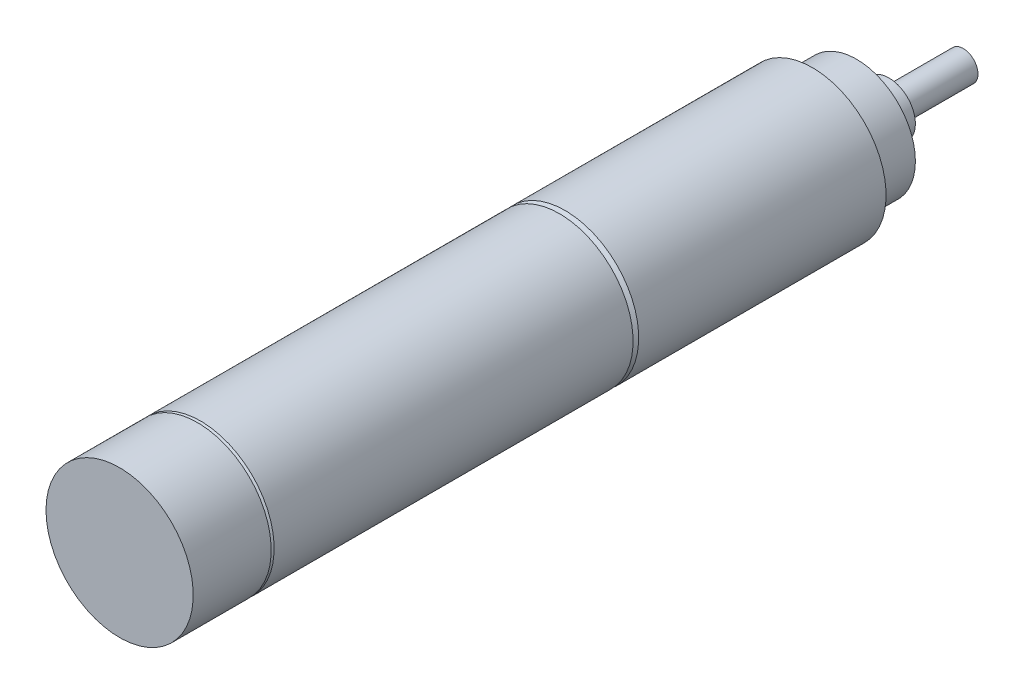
ISO-10303-21;
HEADER;
FILE_DESCRIPTION(('STEP AP214'),'2;1');
FILE_NAME('part.step','',(''),(''),'','','');
FILE_SCHEMA(('AUTOMOTIVE_DESIGN { 1 0 10303 214 1 1 1 1 }'));
ENDSEC;
DATA;
#1=APPLICATION_CONTEXT('core data for automotive mechanical design processes');
#2=APPLICATION_PROTOCOL_DEFINITION('international standard','automotive_design',2000,#1);
#3=PRODUCT_CONTEXT('',#1,'mechanical');
#4=PRODUCT('Part','Part','',(#3));
#5=PRODUCT_RELATED_PRODUCT_CATEGORY('part','',(#4));
#6=PRODUCT_DEFINITION_FORMATION('','',#4);
#7=PRODUCT_DEFINITION_CONTEXT('part definition',#1,'design');
#8=PRODUCT_DEFINITION('design','',#6,#7);
#9=PRODUCT_DEFINITION_SHAPE('','',#8);
#10=(LENGTH_UNIT() NAMED_UNIT(*) SI_UNIT(.MILLI.,.METRE.));
#11=(NAMED_UNIT(*) PLANE_ANGLE_UNIT() SI_UNIT($,.RADIAN.));
#12=(NAMED_UNIT(*) SI_UNIT($,.STERADIAN.) SOLID_ANGLE_UNIT());
#13=UNCERTAINTY_MEASURE_WITH_UNIT(LENGTH_MEASURE(1.E-05),#10,'distance_accuracy_value','');
#14=(GEOMETRIC_REPRESENTATION_CONTEXT(3) GLOBAL_UNCERTAINTY_ASSIGNED_CONTEXT((#13)) GLOBAL_UNIT_ASSIGNED_CONTEXT((#10,
#11,#12)) REPRESENTATION_CONTEXT('',''));
#15=CARTESIAN_POINT('',(0.,0.,0.));
#16=DIRECTION('',(0.,0.,1.));
#17=DIRECTION('',(1.,0.,0.));
#18=AXIS2_PLACEMENT_3D('',#15,#16,#17);
#19=CARTESIAN_POINT('',(0.,0.,-3.99719999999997));
#20=DIRECTION('',(0.,0.,-0.999999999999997));
#21=DIRECTION('',(-1.,0.,0.));
#22=AXIS2_PLACEMENT_3D('',#19,#20,#21);
#23=PLANE('',#22);
#24=CARTESIAN_POINT('',(0.,0.,-3.99719999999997));
#25=DIRECTION('',(0.,0.,-0.999999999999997));
#26=DIRECTION('',(-1.,0.,0.));
#27=AXIS2_PLACEMENT_3D('',#24,#25,#26);
#28=CIRCLE('',#27,2.5);
#29=CARTESIAN_POINT('',(2.50000000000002,0.,-3.99719999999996));
#30=VERTEX_POINT('',#29);
#31=EDGE_CURVE('E90',#30,#30,#28,.T.);
#32=ORIENTED_EDGE('',*,*,#31,.T.);
#33=EDGE_LOOP('',(#32));
#34=FACE_BOUND('',#33,.T.);
#35=CARTESIAN_POINT('',(0.,0.,-3.99719999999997));
#36=DIRECTION('',(0.,0.,-0.999999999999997));
#37=DIRECTION('',(-1.,0.,0.));
#38=AXIS2_PLACEMENT_3D('',#35,#36,#37);
#39=CIRCLE('',#38,1.8);
#40=CARTESIAN_POINT('',(1.80000000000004,0.,-3.99719999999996));
#41=VERTEX_POINT('',#40);
#42=EDGE_CURVE('E102',#41,#41,#39,.T.);
#43=ORIENTED_EDGE('',*,*,#42,.F.);
#44=EDGE_LOOP('',(#43));
#45=FACE_BOUND('',#44,.T.);
#46=ADVANCED_FACE('F39',(#34,#45),#23,.T.);
#47=CARTESIAN_POINT('',(0.,0.,-2.99719999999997));
#48=DIRECTION('',(0.,0.,-0.999999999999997));
#49=DIRECTION('',(-1.,0.,0.));
#50=AXIS2_PLACEMENT_3D('',#47,#48,#49);
#51=PLANE('',#50);
#52=CARTESIAN_POINT('',(0.,0.,-2.99719999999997));
#53=DIRECTION('',(0.,0.,-0.999999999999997));
#54=DIRECTION('',(-1.,0.,0.));
#55=AXIS2_PLACEMENT_3D('',#52,#53,#54);
#56=CIRCLE('',#55,4.0005);
#57=CARTESIAN_POINT('',(4.00050000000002,0.,-2.99719999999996));
#58=VERTEX_POINT('',#57);
#59=EDGE_CURVE('E75',#58,#58,#56,.T.);
#60=ORIENTED_EDGE('',*,*,#59,.T.);
#61=EDGE_LOOP('',(#60));
#62=FACE_BOUND('',#61,.T.);
#63=CARTESIAN_POINT('',(0.,0.,-2.99719999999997));
#64=DIRECTION('',(0.,0.,-0.999999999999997));
#65=DIRECTION('',(-1.,0.,0.));
#66=AXIS2_PLACEMENT_3D('',#63,#64,#65);
#67=CIRCLE('',#66,2.5);
#68=CARTESIAN_POINT('',(2.50000000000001,0.,-2.99719999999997));
#69=VERTEX_POINT('',#68);
#70=EDGE_CURVE('E94',#69,#69,#67,.T.);
#71=ORIENTED_EDGE('',*,*,#70,.F.);
#72=EDGE_LOOP('',(#71));
#73=FACE_BOUND('',#72,.T.);
#74=ADVANCED_FACE('F110',(#62,#73),#51,.T.);
#75=CARTESIAN_POINT('',(0.,0.,0.));
#76=DIRECTION('',(0.,0.,0.999999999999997));
#77=DIRECTION('',(1.,0.,0.));
#78=AXIS2_PLACEMENT_3D('',#75,#76,#77);
#79=PLANE('',#78);
#80=CARTESIAN_POINT('',(0.,0.,0.));
#81=DIRECTION('',(0.,0.,0.999999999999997));
#82=DIRECTION('',(1.,0.,0.));
#83=AXIS2_PLACEMENT_3D('',#80,#81,#82);
#84=CIRCLE('',#83,5.0038);
#85=CARTESIAN_POINT('',(-5.00379999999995,0.,0.));
#86=VERTEX_POINT('',#85);
#87=EDGE_CURVE('E68',#86,#86,#84,.T.);
#88=ORIENTED_EDGE('',*,*,#87,.F.);
#89=EDGE_LOOP('',(#88));
#90=FACE_BOUND('',#89,.T.);
#91=CARTESIAN_POINT('',(0.,0.,0.));
#92=DIRECTION('',(0.,0.,0.999999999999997));
#93=DIRECTION('',(1.,0.,0.));
#94=AXIS2_PLACEMENT_3D('',#91,#92,#93);
#95=CIRCLE('',#94,4.0005);
#96=CARTESIAN_POINT('',(4.00050000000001,0.,0.));
#97=VERTEX_POINT('',#96);
#98=EDGE_CURVE('E54',#97,#97,#95,.F.);
#99=ORIENTED_EDGE('',*,*,#98,.F.);
#100=EDGE_LOOP('',(#99));
#101=FACE_BOUND('',#100,.T.);
#102=ADVANCED_FACE('F116',(#90,#101),#79,.F.);
#103=CARTESIAN_POINT('',(0.,0.,17.1957999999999));
#104=DIRECTION('',(0.,0.,-0.999999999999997));
#105=DIRECTION('',(-1.,0.,0.));
#106=AXIS2_PLACEMENT_3D('',#103,#104,#105);
#107=CYLINDRICAL_SURFACE('',#106,5.0038);
#108=CARTESIAN_POINT('',(0.,0.,16.8147999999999));
#109=DIRECTION('',(0.,0.,0.999999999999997));
#110=DIRECTION('',(1.,0.,0.));
#111=AXIS2_PLACEMENT_3D('',#108,#109,#110);
#112=CIRCLE('',#111,5.0038);
#113=CARTESIAN_POINT('',(-5.00379999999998,0.,16.8147999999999));
#114=VERTEX_POINT('',#113);
#115=EDGE_CURVE('E60',#114,#114,#112,.F.);
#116=CARTESIAN_POINT('',(-5.00379999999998,0.,16.8147999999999));
#117=CARTESIAN_POINT('',(-5.00379999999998,0.,16.6396458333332));
#118=CARTESIAN_POINT('',(-5.00379999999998,0.,16.4644916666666));
#119=CARTESIAN_POINT('',(-5.00379999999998,0.,16.1141833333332));
#120=CARTESIAN_POINT('',(-5.00379999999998,0.,15.9390291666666));
#121=CARTESIAN_POINT('',(-5.00379999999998,0.,15.5887208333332));
#122=CARTESIAN_POINT('',(-5.00379999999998,0.,15.4135666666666));
#123=CARTESIAN_POINT('',(-5.00379999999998,0.,15.0632583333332));
#124=CARTESIAN_POINT('',(-5.00379999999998,0.,14.8881041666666));
#125=CARTESIAN_POINT('',(-5.00379999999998,0.,14.5377958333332));
#126=CARTESIAN_POINT('',(-5.00379999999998,0.,14.3626416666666));
#127=CARTESIAN_POINT('',(-5.00379999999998,0.,14.0123333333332));
#128=CARTESIAN_POINT('',(-5.00379999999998,0.,13.8371791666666));
#129=CARTESIAN_POINT('',(-5.00379999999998,0.,13.4868708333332));
#130=CARTESIAN_POINT('',(-5.00379999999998,0.,13.3117166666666));
#131=CARTESIAN_POINT('',(-5.00379999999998,0.,12.9614083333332));
#132=CARTESIAN_POINT('',(-5.00379999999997,0.,12.7862541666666));
#133=CARTESIAN_POINT('',(-5.00379999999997,0.,12.4359458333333));
#134=CARTESIAN_POINT('',(-5.00379999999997,0.,12.2607916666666));
#135=CARTESIAN_POINT('',(-5.00379999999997,0.,11.9104833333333));
#136=CARTESIAN_POINT('',(-5.00379999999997,0.,11.7353291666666));
#137=CARTESIAN_POINT('',(-5.00379999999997,0.,11.3850208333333));
#138=CARTESIAN_POINT('',(-5.00379999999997,0.,11.2098666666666));
#139=CARTESIAN_POINT('',(-5.00379999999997,0.,10.8595583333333));
#140=CARTESIAN_POINT('',(-5.00379999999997,0.,10.6844041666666));
#141=CARTESIAN_POINT('',(-5.00379999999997,0.,10.3340958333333));
#142=CARTESIAN_POINT('',(-5.00379999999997,0.,10.1589416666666));
#143=CARTESIAN_POINT('',(-5.00379999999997,0.,9.80863333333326));
#144=CARTESIAN_POINT('',(-5.00379999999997,0.,9.6334791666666));
#145=CARTESIAN_POINT('',(-5.00379999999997,0.,9.28317083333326));
#146=CARTESIAN_POINT('',(-5.00379999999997,0.,9.1080166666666));
#147=CARTESIAN_POINT('',(-5.00379999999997,0.,8.75770833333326));
#148=CARTESIAN_POINT('',(-5.00379999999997,0.,8.5825541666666));
#149=CARTESIAN_POINT('',(-5.00379999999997,0.,8.23224583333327));
#150=CARTESIAN_POINT('',(-5.00379999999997,0.,8.0570916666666));
#151=CARTESIAN_POINT('',(-5.00379999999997,0.,7.70678333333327));
#152=CARTESIAN_POINT('',(-5.00379999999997,0.,7.5316291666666));
#153=CARTESIAN_POINT('',(-5.00379999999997,0.,7.18132083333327));
#154=CARTESIAN_POINT('',(-5.00379999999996,0.,7.0061666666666));
#155=CARTESIAN_POINT('',(-5.00379999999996,0.,6.65585833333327));
#156=CARTESIAN_POINT('',(-5.00379999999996,0.,6.48070416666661));
#157=CARTESIAN_POINT('',(-5.00379999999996,0.,6.13039583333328));
#158=CARTESIAN_POINT('',(-5.00379999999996,0.,5.95524166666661));
#159=CARTESIAN_POINT('',(-5.00379999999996,0.,5.60493333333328));
#160=CARTESIAN_POINT('',(-5.00379999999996,0.,5.42977916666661));
#161=CARTESIAN_POINT('',(-5.00379999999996,0.,5.07947083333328));
#162=CARTESIAN_POINT('',(-5.00379999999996,0.,4.90431666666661));
#163=CARTESIAN_POINT('',(-5.00379999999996,0.,4.55400833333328));
#164=CARTESIAN_POINT('',(-5.00379999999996,0.,4.37885416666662));
#165=CARTESIAN_POINT('',(-5.00379999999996,0.,4.02854583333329));
#166=CARTESIAN_POINT('',(-5.00379999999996,0.,3.85339166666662));
#167=CARTESIAN_POINT('',(-5.00379999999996,0.,3.50308333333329));
#168=CARTESIAN_POINT('',(-5.00379999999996,0.,3.32792916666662));
#169=CARTESIAN_POINT('',(-5.00379999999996,0.,2.97762083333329));
#170=CARTESIAN_POINT('',(-5.00379999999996,0.,2.80246666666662));
#171=CARTESIAN_POINT('',(-5.00379999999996,0.,2.45215833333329));
#172=CARTESIAN_POINT('',(-5.00379999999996,0.,2.27700416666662));
#173=CARTESIAN_POINT('',(-5.00379999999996,0.,1.92669583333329));
#174=CARTESIAN_POINT('',(-5.00379999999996,0.,1.75154166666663));
#175=CARTESIAN_POINT('',(-5.00379999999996,0.,1.4012333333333));
#176=CARTESIAN_POINT('',(-5.00379999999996,0.,1.22607916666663));
#177=CARTESIAN_POINT('',(-5.00379999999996,0.,0.875770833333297));
#178=CARTESIAN_POINT('',(-5.00379999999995,0.,0.700616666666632));
#179=CARTESIAN_POINT('',(-5.00379999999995,0.,0.3503083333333));
#180=CARTESIAN_POINT('',(-5.00379999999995,0.,0.175154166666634));
#181=CARTESIAN_POINT('',(-5.00379999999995,0.,0.));
#182=B_SPLINE_CURVE_WITH_KNOTS('',3,(#116,#117,#118,#119,#120,#121,#122,#123,#124,#125,#126,
#127,#128,#129,#130,#131,#132,#133,#134,#135,#136,#137,#138,#139,#140,#141,#142,#143,#144,#145,
#146,#147,#148,#149,#150,#151,#152,#153,#154,#155,#156,#157,#158,#159,#160,#161,#162,#163,#164,
#165,#166,#167,#168,#169,#170,#171,#172,#173,#174,#175,#176,#177,#178,#179,#180,#181),
.UNSPECIFIED.,.F.,.F.,(4,2,2,2,2,2,2,2,2,2,2,2,2,2,2,2,2,2,2,2,2,2,2,2,2,2,2,2,2,2,2,2,4),(0.,
0.525462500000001,1.050925,1.57638749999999,2.10184999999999,2.62731249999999,3.15277499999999,
3.67823749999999,4.20369999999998,4.72916249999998,5.25462499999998,5.78008749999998,
6.30554999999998,6.83101249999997,7.35647499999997,7.88193749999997,8.40739999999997,
8.93286249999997,9.45832499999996,9.98378749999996,10.50925,11.0347125,11.560175,12.0856375,
12.6110999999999,13.1365624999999,13.6620249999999,14.1874874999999,14.7129499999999,
15.2384124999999,15.7638749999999,16.2893374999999,16.8147999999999),.UNSPECIFIED.);
#183=EDGE_CURVE('BSEAM41',#114,#86,#182,.T.);
#184=ORIENTED_EDGE('',*,*,#115,.T.);
#185=ORIENTED_EDGE('',*,*,#87,.T.);
#186=ORIENTED_EDGE('',*,*,#183,.T.);
#187=ORIENTED_EDGE('',*,*,#183,.F.);
#188=EDGE_LOOP('',(#184,#186,#185,#187));
#189=FACE_BOUND('',#188,.T.);
#190=ADVANCED_FACE('F41',(#189),#107,.T.);
#191=CARTESIAN_POINT('',(0.,0.,17.1957999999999));
#192=DIRECTION('',(0.,0.,-0.999999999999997));
#193=DIRECTION('',(-1.,0.,0.));
#194=AXIS2_PLACEMENT_3D('',#191,#192,#193);
#195=CONICAL_SURFACE('',#194,4.6228,0.785398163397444);
#196=CARTESIAN_POINT('',(0.,0.,17.1957999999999));
#197=DIRECTION('',(0.,0.,0.999999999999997));
#198=DIRECTION('',(1.,0.,0.));
#199=AXIS2_PLACEMENT_3D('',#196,#197,#198);
#200=CIRCLE('',#199,4.6228);
#201=CARTESIAN_POINT('',(-4.6228,0.,17.1957999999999));
#202=VERTEX_POINT('',#201);
#203=EDGE_CURVE('E64',#202,#202,#200,.T.);
#204=CARTESIAN_POINT('',(-5.00380000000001,0.,16.8147999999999));
#205=CARTESIAN_POINT('',(-4.99983125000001,0.,16.8187687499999));
#206=CARTESIAN_POINT('',(-4.99586250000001,0.,16.8227374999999));
#207=CARTESIAN_POINT('',(-4.98792500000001,0.,16.8306749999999));
#208=CARTESIAN_POINT('',(-4.98395625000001,0.,16.8346437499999));
#209=CARTESIAN_POINT('',(-4.97601875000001,0.,16.8425812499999));
#210=CARTESIAN_POINT('',(-4.97205000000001,0.,16.8465499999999));
#211=CARTESIAN_POINT('',(-4.96411250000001,0.,16.8544874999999));
#212=CARTESIAN_POINT('',(-4.96014375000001,0.,16.8584562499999));
#213=CARTESIAN_POINT('',(-4.95220625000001,0.,16.8663937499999));
#214=CARTESIAN_POINT('',(-4.94823750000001,0.,16.8703624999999));
#215=CARTESIAN_POINT('',(-4.94030000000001,0.,16.8782999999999));
#216=CARTESIAN_POINT('',(-4.93633125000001,0.,16.8822687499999));
#217=CARTESIAN_POINT('',(-4.92839375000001,0.,16.8902062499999));
#218=CARTESIAN_POINT('',(-4.92442500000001,0.,16.8941749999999));
#219=CARTESIAN_POINT('',(-4.91648750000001,0.,16.9021124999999));
#220=CARTESIAN_POINT('',(-4.91251875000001,0.,16.9060812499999));
#221=CARTESIAN_POINT('',(-4.90458125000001,0.,16.9140187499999));
#222=CARTESIAN_POINT('',(-4.90061250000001,0.,16.9179874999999));
#223=CARTESIAN_POINT('',(-4.89267500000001,0.,16.9259249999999));
#224=CARTESIAN_POINT('',(-4.88870625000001,0.,16.9298937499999));
#225=CARTESIAN_POINT('',(-4.88076875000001,0.,16.9378312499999));
#226=CARTESIAN_POINT('',(-4.87680000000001,0.,16.9417999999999));
#227=CARTESIAN_POINT('',(-4.86886250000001,0.,16.9497374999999));
#228=CARTESIAN_POINT('',(-4.86489375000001,0.,16.9537062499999));
#229=CARTESIAN_POINT('',(-4.85695625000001,0.,16.9616437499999));
#230=CARTESIAN_POINT('',(-4.85298750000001,0.,16.9656124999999));
#231=CARTESIAN_POINT('',(-4.84505000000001,0.,16.9735499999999));
#232=CARTESIAN_POINT('',(-4.84108125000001,0.,16.9775187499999));
#233=CARTESIAN_POINT('',(-4.83314375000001,0.,16.9854562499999));
#234=CARTESIAN_POINT('',(-4.82917500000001,0.,16.9894249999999));
#235=CARTESIAN_POINT('',(-4.82123750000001,0.,16.9973624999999));
#236=CARTESIAN_POINT('',(-4.81726875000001,0.,17.0013312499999));
#237=CARTESIAN_POINT('',(-4.80933125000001,0.,17.0092687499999));
#238=CARTESIAN_POINT('',(-4.80536250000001,0.,17.0132374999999));
#239=CARTESIAN_POINT('',(-4.79742500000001,0.,17.0211749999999));
#240=CARTESIAN_POINT('',(-4.79345625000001,0.,17.0251437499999));
#241=CARTESIAN_POINT('',(-4.78551875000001,0.,17.0330812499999));
#242=CARTESIAN_POINT('',(-4.78155000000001,0.,17.0370499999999));
#243=CARTESIAN_POINT('',(-4.77361250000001,0.,17.0449874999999));
#244=CARTESIAN_POINT('',(-4.76964375,0.,17.0489562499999));
#245=CARTESIAN_POINT('',(-4.76170625,0.,17.0568937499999));
#246=CARTESIAN_POINT('',(-4.7577375,0.,17.0608624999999));
#247=CARTESIAN_POINT('',(-4.7498,0.,17.0687999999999));
#248=CARTESIAN_POINT('',(-4.74583125,0.,17.0727687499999));
#249=CARTESIAN_POINT('',(-4.73789375,0.,17.0807062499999));
#250=CARTESIAN_POINT('',(-4.733925,0.,17.0846749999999));
#251=CARTESIAN_POINT('',(-4.7259875,0.,17.0926124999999));
#252=CARTESIAN_POINT('',(-4.72201875,0.,17.0965812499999));
#253=CARTESIAN_POINT('',(-4.71408125,0.,17.1045187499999));
#254=CARTESIAN_POINT('',(-4.7101125,0.,17.1084874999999));
#255=CARTESIAN_POINT('',(-4.702175,0.,17.1164249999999));
#256=CARTESIAN_POINT('',(-4.69820625,0.,17.1203937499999));
#257=CARTESIAN_POINT('',(-4.69026875,0.,17.1283312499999));
#258=CARTESIAN_POINT('',(-4.6863,0.,17.1322999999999));
#259=CARTESIAN_POINT('',(-4.6783625,0.,17.1402374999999));
#260=CARTESIAN_POINT('',(-4.67439375,0.,17.1442062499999));
#261=CARTESIAN_POINT('',(-4.66645625,0.,17.1521437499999));
#262=CARTESIAN_POINT('',(-4.6624875,0.,17.1561124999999));
#263=CARTESIAN_POINT('',(-4.65455,0.,17.1640499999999));
#264=CARTESIAN_POINT('',(-4.65058125,0.,17.1680187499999));
#265=CARTESIAN_POINT('',(-4.64264375,0.,17.1759562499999));
#266=CARTESIAN_POINT('',(-4.638675,0.,17.1799249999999));
#267=CARTESIAN_POINT('',(-4.6307375,0.,17.1878624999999));
#268=CARTESIAN_POINT('',(-4.62676875,0.,17.1918312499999));
#269=CARTESIAN_POINT('',(-4.6228,0.,17.1957999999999));
#270=B_SPLINE_CURVE_WITH_KNOTS('',3,(#204,#205,#206,#207,#208,#209,#210,#211,#212,#213,#214,
#215,#216,#217,#218,#219,#220,#221,#222,#223,#224,#225,#226,#227,#228,#229,#230,#231,#232,#233,
#234,#235,#236,#237,#238,#239,#240,#241,#242,#243,#244,#245,#246,#247,#248,#249,#250,#251,#252,
#253,#254,#255,#256,#257,#258,#259,#260,#261,#262,#263,#264,#265,#266,#267,#268,#269),
.UNSPECIFIED.,.F.,.F.,(4,2,2,2,2,2,2,2,2,2,2,2,2,2,2,2,2,2,2,2,2,2,2,2,2,2,2,2,2,2,2,2,4),(0.,
0.0168379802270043,0.0336759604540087,0.0505139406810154,0.0673519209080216,0.0841899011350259,
0.101027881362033,0.117865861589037,0.134703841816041,0.151541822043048,0.168379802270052,
0.185217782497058,0.202055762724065,0.218893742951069,0.235731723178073,0.25256970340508,
0.269407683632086,0.286245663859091,0.303083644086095,0.319921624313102,0.336759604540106,
0.353597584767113,0.370435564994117,0.387273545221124,0.404111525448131,0.420949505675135,
0.437787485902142,0.454625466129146,0.471463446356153,0.488301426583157,0.505139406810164,
0.521977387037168,0.538815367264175),.UNSPECIFIED.);
#271=EDGE_CURVE('BSEAM162',#114,#202,#270,.T.);
#272=ORIENTED_EDGE('',*,*,#115,.F.);
#273=ORIENTED_EDGE('',*,*,#203,.F.);
#274=ORIENTED_EDGE('',*,*,#271,.T.);
#275=ORIENTED_EDGE('',*,*,#271,.F.);
#276=EDGE_LOOP('',(#272,#274,#273,#275));
#277=FACE_BOUND('',#276,.T.);
#278=ADVANCED_FACE('F162',(#277),#195,.T.);
#279=CARTESIAN_POINT('',(0.,0.,41.7957999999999));
#280=DIRECTION('',(0.,0.,-0.999999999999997));
#281=DIRECTION('',(-1.,0.,0.));
#282=AXIS2_PLACEMENT_3D('',#279,#280,#281);
#283=CYLINDRICAL_SURFACE('',#282,5.0038);
#284=CARTESIAN_POINT('',(0.,0.,41.5957999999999));
#285=DIRECTION('',(0.,0.,0.999999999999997));
#286=DIRECTION('',(1.,0.,0.));
#287=AXIS2_PLACEMENT_3D('',#284,#285,#286);
#288=CIRCLE('',#287,5.0038);
#289=CARTESIAN_POINT('',(-5.00380000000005,0.,41.5957999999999));
#290=VERTEX_POINT('',#289);
#291=EDGE_CURVE('E10',#290,#290,#288,.F.);
#292=CARTESIAN_POINT('',(0.,0.,17.1957999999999));
#293=DIRECTION('',(0.,0.,0.999999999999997));
#294=DIRECTION('',(1.,0.,0.));
#295=AXIS2_PLACEMENT_3D('',#292,#293,#294);
#296=CIRCLE('',#295,5.0038);
#297=CARTESIAN_POINT('',(-5.00380000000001,0.,17.1957999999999));
#298=VERTEX_POINT('',#297);
#299=EDGE_CURVE('E72',#298,#298,#296,.T.);
#300=CARTESIAN_POINT('',(-5.00380000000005,0.,41.5957999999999));
#301=CARTESIAN_POINT('',(-5.00380000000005,0.,41.3416333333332));
#302=CARTESIAN_POINT('',(-5.00380000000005,0.,41.0874666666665));
#303=CARTESIAN_POINT('',(-5.00380000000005,0.,40.5791333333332));
#304=CARTESIAN_POINT('',(-5.00380000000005,0.,40.3249666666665));
#305=CARTESIAN_POINT('',(-5.00380000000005,0.,39.8166333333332));
#306=CARTESIAN_POINT('',(-5.00380000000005,0.,39.5624666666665));
#307=CARTESIAN_POINT('',(-5.00380000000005,0.,39.0541333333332));
#308=CARTESIAN_POINT('',(-5.00380000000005,0.,38.7999666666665));
#309=CARTESIAN_POINT('',(-5.00380000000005,0.,38.2916333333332));
#310=CARTESIAN_POINT('',(-5.00380000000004,0.,38.0374666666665));
#311=CARTESIAN_POINT('',(-5.00380000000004,0.,37.5291333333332));
#312=CARTESIAN_POINT('',(-5.00380000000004,0.,37.2749666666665));
#313=CARTESIAN_POINT('',(-5.00380000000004,0.,36.7666333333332));
#314=CARTESIAN_POINT('',(-5.00380000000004,0.,36.5124666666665));
#315=CARTESIAN_POINT('',(-5.00380000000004,0.,36.0041333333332));
#316=CARTESIAN_POINT('',(-5.00380000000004,0.,35.7499666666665));
#317=CARTESIAN_POINT('',(-5.00380000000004,0.,35.2416333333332));
#318=CARTESIAN_POINT('',(-5.00380000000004,0.,34.9874666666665));
#319=CARTESIAN_POINT('',(-5.00380000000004,0.,34.4791333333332));
#320=CARTESIAN_POINT('',(-5.00380000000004,0.,34.2249666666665));
#321=CARTESIAN_POINT('',(-5.00380000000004,0.,33.7166333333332));
#322=CARTESIAN_POINT('',(-5.00380000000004,0.,33.4624666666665));
#323=CARTESIAN_POINT('',(-5.00380000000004,0.,32.9541333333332));
#324=CARTESIAN_POINT('',(-5.00380000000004,0.,32.6999666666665));
#325=CARTESIAN_POINT('',(-5.00380000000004,0.,32.1916333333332));
#326=CARTESIAN_POINT('',(-5.00380000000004,0.,31.9374666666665));
#327=CARTESIAN_POINT('',(-5.00380000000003,0.,31.4291333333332));
#328=CARTESIAN_POINT('',(-5.00380000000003,0.,31.1749666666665));
#329=CARTESIAN_POINT('',(-5.00380000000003,0.,30.6666333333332));
#330=CARTESIAN_POINT('',(-5.00380000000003,0.,30.4124666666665));
#331=CARTESIAN_POINT('',(-5.00380000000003,0.,29.9041333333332));
#332=CARTESIAN_POINT('',(-5.00380000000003,0.,29.6499666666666));
#333=CARTESIAN_POINT('',(-5.00380000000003,0.,29.1416333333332));
#334=CARTESIAN_POINT('',(-5.00380000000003,0.,28.8874666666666));
#335=CARTESIAN_POINT('',(-5.00380000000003,0.,28.3791333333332));
#336=CARTESIAN_POINT('',(-5.00380000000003,0.,28.1249666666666));
#337=CARTESIAN_POINT('',(-5.00380000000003,0.,27.6166333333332));
#338=CARTESIAN_POINT('',(-5.00380000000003,0.,27.3624666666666));
#339=CARTESIAN_POINT('',(-5.00380000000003,0.,26.8541333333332));
#340=CARTESIAN_POINT('',(-5.00380000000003,0.,26.5999666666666));
#341=CARTESIAN_POINT('',(-5.00380000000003,0.,26.0916333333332));
#342=CARTESIAN_POINT('',(-5.00380000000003,0.,25.8374666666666));
#343=CARTESIAN_POINT('',(-5.00380000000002,0.,25.3291333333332));
#344=CARTESIAN_POINT('',(-5.00380000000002,0.,25.0749666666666));
#345=CARTESIAN_POINT('',(-5.00380000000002,0.,24.5666333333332));
#346=CARTESIAN_POINT('',(-5.00380000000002,0.,24.3124666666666));
#347=CARTESIAN_POINT('',(-5.00380000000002,0.,23.8041333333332));
#348=CARTESIAN_POINT('',(-5.00380000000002,0.,23.5499666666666));
#349=CARTESIAN_POINT('',(-5.00380000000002,0.,23.0416333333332));
#350=CARTESIAN_POINT('',(-5.00380000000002,0.,22.7874666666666));
#351=CARTESIAN_POINT('',(-5.00380000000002,0.,22.2791333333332));
#352=CARTESIAN_POINT('',(-5.00380000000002,0.,22.0249666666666));
#353=CARTESIAN_POINT('',(-5.00380000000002,0.,21.5166333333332));
#354=CARTESIAN_POINT('',(-5.00380000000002,0.,21.2624666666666));
#355=CARTESIAN_POINT('',(-5.00380000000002,0.,20.7541333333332));
#356=CARTESIAN_POINT('',(-5.00380000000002,0.,20.4999666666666));
#357=CARTESIAN_POINT('',(-5.00380000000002,0.,19.9916333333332));
#358=CARTESIAN_POINT('',(-5.00380000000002,0.,19.7374666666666));
#359=CARTESIAN_POINT('',(-5.00380000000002,0.,19.2291333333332));
#360=CARTESIAN_POINT('',(-5.00380000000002,0.,18.9749666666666));
#361=CARTESIAN_POINT('',(-5.00380000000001,0.,18.4666333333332));
#362=CARTESIAN_POINT('',(-5.00380000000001,0.,18.2124666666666));
#363=CARTESIAN_POINT('',(-5.00380000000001,0.,17.7041333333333));
#364=CARTESIAN_POINT('',(-5.00380000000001,0.,17.4499666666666));
#365=CARTESIAN_POINT('',(-5.00380000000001,0.,17.1957999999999));
#366=B_SPLINE_CURVE_WITH_KNOTS('',3,(#300,#301,#302,#303,#304,#305,#306,#307,#308,#309,#310,
#311,#312,#313,#314,#315,#316,#317,#318,#319,#320,#321,#322,#323,#324,#325,#326,#327,#328,#329,
#330,#331,#332,#333,#334,#335,#336,#337,#338,#339,#340,#341,#342,#343,#344,#345,#346,#347,#348,
#349,#350,#351,#352,#353,#354,#355,#356,#357,#358,#359,#360,#361,#362,#363,#364,#365),
.UNSPECIFIED.,.F.,.F.,(4,2,2,2,2,2,2,2,2,2,2,2,2,2,2,2,2,2,2,2,2,2,2,2,2,2,2,2,2,2,2,2,4),(0.,
0.762499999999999,1.525,2.2875,3.05,3.81249999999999,4.57499999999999,5.33749999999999,
6.09999999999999,6.86249999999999,7.62499999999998,8.38749999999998,9.14999999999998,
9.91249999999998,10.675,11.4375,12.2,12.9625,13.725,14.4875,15.25,16.0125,16.775,17.5375,18.3,
19.0625,19.8249999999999,20.5874999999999,21.3499999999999,22.1124999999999,22.8749999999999,
23.6374999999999,24.3999999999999),.UNSPECIFIED.);
#367=EDGE_CURVE('BSEAM158',#290,#298,#366,.T.);
#368=ORIENTED_EDGE('',*,*,#291,.T.);
#369=ORIENTED_EDGE('',*,*,#299,.T.);
#370=ORIENTED_EDGE('',*,*,#367,.T.);
#371=ORIENTED_EDGE('',*,*,#367,.F.);
#372=EDGE_LOOP('',(#368,#370,#369,#371));
#373=FACE_BOUND('',#372,.T.);
#374=ADVANCED_FACE('F158',(#373),#283,.T.);
#375=CARTESIAN_POINT('',(0.,0.,17.1957999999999));
#376=DIRECTION('',(0.,0.,0.999999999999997));
#377=DIRECTION('',(1.,0.,0.));
#378=AXIS2_PLACEMENT_3D('',#375,#376,#377);
#379=PLANE('',#378);
#380=ORIENTED_EDGE('',*,*,#203,.T.);
#381=EDGE_LOOP('',(#380));
#382=FACE_BOUND('',#381,.T.);
#383=ORIENTED_EDGE('',*,*,#299,.F.);
#384=EDGE_LOOP('',(#383));
#385=FACE_BOUND('',#384,.T.);
#386=ADVANCED_FACE('F154',(#382,#385),#379,.F.);
#387=CARTESIAN_POINT('',(0.,0.,-2.99719999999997));
#388=DIRECTION('',(0.,0.,0.999999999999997));
#389=DIRECTION('',(1.,0.,0.));
#390=AXIS2_PLACEMENT_3D('',#387,#388,#389);
#391=CYLINDRICAL_SURFACE('',#390,4.0005);
#392=CARTESIAN_POINT('',(4.00050000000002,0.,-2.99719999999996));
#393=CARTESIAN_POINT('',(4.00050000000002,0.,-2.96597916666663));
#394=CARTESIAN_POINT('',(4.00050000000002,0.,-2.9347583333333));
#395=CARTESIAN_POINT('',(4.00050000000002,0.,-2.87231666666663));
#396=CARTESIAN_POINT('',(4.00050000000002,0.,-2.8410958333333));
#397=CARTESIAN_POINT('',(4.00050000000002,0.,-2.77865416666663));
#398=CARTESIAN_POINT('',(4.00050000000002,0.,-2.7474333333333));
#399=CARTESIAN_POINT('',(4.00050000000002,0.,-2.68499166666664));
#400=CARTESIAN_POINT('',(4.00050000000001,0.,-2.6537708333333));
#401=CARTESIAN_POINT('',(4.00050000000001,0.,-2.59132916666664));
#402=CARTESIAN_POINT('',(4.00050000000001,0.,-2.5601083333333));
#403=CARTESIAN_POINT('',(4.00050000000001,0.,-2.49766666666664));
#404=CARTESIAN_POINT('',(4.00050000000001,0.,-2.46644583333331));
#405=CARTESIAN_POINT('',(4.00050000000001,0.,-2.40400416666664));
#406=CARTESIAN_POINT('',(4.00050000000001,0.,-2.37278333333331));
#407=CARTESIAN_POINT('',(4.00050000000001,0.,-2.31034166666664));
#408=CARTESIAN_POINT('',(4.00050000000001,0.,-2.27912083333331));
#409=CARTESIAN_POINT('',(4.00050000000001,0.,-2.21667916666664));
#410=CARTESIAN_POINT('',(4.00050000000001,0.,-2.18545833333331));
#411=CARTESIAN_POINT('',(4.00050000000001,0.,-2.12301666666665));
#412=CARTESIAN_POINT('',(4.00050000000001,0.,-2.09179583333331));
#413=CARTESIAN_POINT('',(4.00050000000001,0.,-2.02935416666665));
#414=CARTESIAN_POINT('',(4.00050000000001,0.,-1.99813333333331));
#415=CARTESIAN_POINT('',(4.00050000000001,0.,-1.93569166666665));
#416=CARTESIAN_POINT('',(4.00050000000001,0.,-1.90447083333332));
#417=CARTESIAN_POINT('',(4.00050000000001,0.,-1.84202916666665));
#418=CARTESIAN_POINT('',(4.00050000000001,0.,-1.81080833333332));
#419=CARTESIAN_POINT('',(4.00050000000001,0.,-1.74836666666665));
#420=CARTESIAN_POINT('',(4.00050000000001,0.,-1.71714583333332));
#421=CARTESIAN_POINT('',(4.00050000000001,0.,-1.65470416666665));
#422=CARTESIAN_POINT('',(4.00050000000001,0.,-1.62348333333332));
#423=CARTESIAN_POINT('',(4.00050000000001,0.,-1.56104166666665));
#424=CARTESIAN_POINT('',(4.00050000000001,0.,-1.52982083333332));
#425=CARTESIAN_POINT('',(4.00050000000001,0.,-1.46737916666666));
#426=CARTESIAN_POINT('',(4.00050000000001,0.,-1.43615833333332));
#427=CARTESIAN_POINT('',(4.00050000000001,0.,-1.37371666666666));
#428=CARTESIAN_POINT('',(4.00050000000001,0.,-1.34249583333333));
#429=CARTESIAN_POINT('',(4.00050000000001,0.,-1.28005416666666));
#430=CARTESIAN_POINT('',(4.00050000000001,0.,-1.24883333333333));
#431=CARTESIAN_POINT('',(4.00050000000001,0.,-1.18639166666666));
#432=CARTESIAN_POINT('',(4.00050000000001,0.,-1.15517083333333));
#433=CARTESIAN_POINT('',(4.00050000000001,0.,-1.09272916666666));
#434=CARTESIAN_POINT('',(4.00050000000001,0.,-1.06150833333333));
#435=CARTESIAN_POINT('',(4.00050000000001,0.,-0.999066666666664));
#436=CARTESIAN_POINT('',(4.00050000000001,0.,-0.967845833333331));
#437=CARTESIAN_POINT('',(4.00050000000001,0.,-0.905404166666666));
#438=CARTESIAN_POINT('',(4.00050000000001,0.,-0.874183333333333));
#439=CARTESIAN_POINT('',(4.00050000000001,0.,-0.811741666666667));
#440=CARTESIAN_POINT('',(4.00050000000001,0.,-0.780520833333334));
#441=CARTESIAN_POINT('',(4.00050000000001,0.,-0.718079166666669));
#442=CARTESIAN_POINT('',(4.00050000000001,0.,-0.686858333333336));
#443=CARTESIAN_POINT('',(4.00050000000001,0.,-0.624416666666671));
#444=CARTESIAN_POINT('',(4.00050000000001,0.,-0.593195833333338));
#445=CARTESIAN_POINT('',(4.00050000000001,0.,-0.530754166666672));
#446=CARTESIAN_POINT('',(4.00050000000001,0.,-0.499533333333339));
#447=CARTESIAN_POINT('',(4.00050000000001,0.,-0.437091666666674));
#448=CARTESIAN_POINT('',(4.00050000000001,0.,-0.405870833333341));
#449=CARTESIAN_POINT('',(4.00050000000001,0.,-0.343429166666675));
#450=CARTESIAN_POINT('',(4.00050000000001,0.,-0.312208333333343));
#451=CARTESIAN_POINT('',(4.00050000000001,0.,-0.249766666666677));
#452=CARTESIAN_POINT('',(4.00050000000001,0.,-0.218545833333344));
#453=CARTESIAN_POINT('',(4.00050000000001,0.,-0.156104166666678));
#454=CARTESIAN_POINT('',(4.00050000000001,0.,-0.124883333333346));
#455=CARTESIAN_POINT('',(4.00050000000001,0.,-0.0624416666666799));
#456=CARTESIAN_POINT('',(4.00050000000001,0.,-0.0312208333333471));
#457=CARTESIAN_POINT('',(4.00050000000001,0.,0.));
#458=B_SPLINE_CURVE_WITH_KNOTS('',3,(#392,#393,#394,#395,#396,#397,#398,#399,#400,#401,#402,
#403,#404,#405,#406,#407,#408,#409,#410,#411,#412,#413,#414,#415,#416,#417,#418,#419,#420,#421,
#422,#423,#424,#425,#426,#427,#428,#429,#430,#431,#432,#433,#434,#435,#436,#437,#438,#439,#440,
#441,#442,#443,#444,#445,#446,#447,#448,#449,#450,#451,#452,#453,#454,#455,#456,#457),
.UNSPECIFIED.,.F.,.F.,(4,2,2,2,2,2,2,2,2,2,2,2,2,2,2,2,2,2,2,2,2,2,2,2,2,2,2,2,2,2,2,2,4),(0.,
0.093662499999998,0.187324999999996,0.280987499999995,0.374649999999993,0.468312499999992,
0.56197499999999,0.655637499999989,0.749299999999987,0.842962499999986,0.936624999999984,
1.03028749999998,1.12394999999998,1.21761249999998,1.31127499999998,1.40493749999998,
1.49859999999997,1.59226249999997,1.68592499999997,1.77958749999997,1.87324999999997,
1.96691249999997,2.06057499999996,2.15423749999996,2.24789999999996,2.34156249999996,
2.43522499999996,2.52888749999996,2.62254999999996,2.71621249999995,2.80987499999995,
2.90353749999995,2.99719999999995),.UNSPECIFIED.);
#459=EDGE_CURVE('BSEAM142',#58,#97,#458,.T.);
#460=ORIENTED_EDGE('',*,*,#59,.F.);
#461=ORIENTED_EDGE('',*,*,#98,.T.);
#462=ORIENTED_EDGE('',*,*,#459,.T.);
#463=ORIENTED_EDGE('',*,*,#459,.F.);
#464=EDGE_LOOP('',(#460,#462,#461,#463));
#465=FACE_BOUND('',#464,.T.);
#466=ADVANCED_FACE('F142',(#465),#391,.T.);
#467=CARTESIAN_POINT('',(0.,0.,41.7957999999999));
#468=DIRECTION('',(0.,0.,-0.999999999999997));
#469=DIRECTION('',(-1.,0.,0.));
#470=AXIS2_PLACEMENT_3D('',#467,#468,#469);
#471=CONICAL_SURFACE('',#470,4.8038,0.785398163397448);
#472=CARTESIAN_POINT('',(0.,0.,41.7957999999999));
#473=DIRECTION('',(0.,0.,0.999999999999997));
#474=DIRECTION('',(1.,0.,0.));
#475=AXIS2_PLACEMENT_3D('',#472,#473,#474);
#476=CIRCLE('',#475,4.8038);
#477=CARTESIAN_POINT('',(-4.80380000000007,0.,41.7957999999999));
#478=VERTEX_POINT('',#477);
#479=EDGE_CURVE('E48',#478,#478,#476,.T.);
#480=CARTESIAN_POINT('',(-5.00380000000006,0.,41.5957999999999));
#481=CARTESIAN_POINT('',(-5.00171666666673,0.,41.5978833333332));
#482=CARTESIAN_POINT('',(-4.99963333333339,0.,41.5999666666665));
#483=CARTESIAN_POINT('',(-4.99546666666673,0.,41.6041333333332));
#484=CARTESIAN_POINT('',(-4.9933833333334,0.,41.6062166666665));
#485=CARTESIAN_POINT('',(-4.98921666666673,0.,41.6103833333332));
#486=CARTESIAN_POINT('',(-4.98713333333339,0.,41.6124666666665));
#487=CARTESIAN_POINT('',(-4.98296666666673,0.,41.6166333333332));
#488=CARTESIAN_POINT('',(-4.9808833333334,0.,41.6187166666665));
#489=CARTESIAN_POINT('',(-4.97671666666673,0.,41.6228833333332));
#490=CARTESIAN_POINT('',(-4.9746333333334,0.,41.6249666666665));
#491=CARTESIAN_POINT('',(-4.97046666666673,0.,41.6291333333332));
#492=CARTESIAN_POINT('',(-4.9683833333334,0.,41.6312166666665));
#493=CARTESIAN_POINT('',(-4.96421666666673,0.,41.6353833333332));
#494=CARTESIAN_POINT('',(-4.9621333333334,0.,41.6374666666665));
#495=CARTESIAN_POINT('',(-4.95796666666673,0.,41.6416333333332));
#496=CARTESIAN_POINT('',(-4.9558833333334,0.,41.6437166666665));
#497=CARTESIAN_POINT('',(-4.95171666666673,0.,41.6478833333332));
#498=CARTESIAN_POINT('',(-4.9496333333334,0.,41.6499666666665));
#499=CARTESIAN_POINT('',(-4.94546666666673,0.,41.6541333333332));
#500=CARTESIAN_POINT('',(-4.9433833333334,0.,41.6562166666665));
#501=CARTESIAN_POINT('',(-4.93921666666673,0.,41.6603833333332));
#502=CARTESIAN_POINT('',(-4.9371333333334,0.,41.6624666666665));
#503=CARTESIAN_POINT('',(-4.93296666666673,0.,41.6666333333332));
#504=CARTESIAN_POINT('',(-4.9308833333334,0.,41.6687166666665));
#505=CARTESIAN_POINT('',(-4.92671666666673,0.,41.6728833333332));
#506=CARTESIAN_POINT('',(-4.9246333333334,0.,41.6749666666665));
#507=CARTESIAN_POINT('',(-4.92046666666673,0.,41.6791333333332));
#508=CARTESIAN_POINT('',(-4.9183833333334,0.,41.6812166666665));
#509=CARTESIAN_POINT('',(-4.91421666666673,0.,41.6853833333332));
#510=CARTESIAN_POINT('',(-4.9121333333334,0.,41.6874666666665));
#511=CARTESIAN_POINT('',(-4.90796666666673,0.,41.6916333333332));
#512=CARTESIAN_POINT('',(-4.9058833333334,0.,41.6937166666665));
#513=CARTESIAN_POINT('',(-4.90171666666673,0.,41.6978833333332));
#514=CARTESIAN_POINT('',(-4.8996333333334,0.,41.6999666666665));
#515=CARTESIAN_POINT('',(-4.89546666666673,0.,41.7041333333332));
#516=CARTESIAN_POINT('',(-4.8933833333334,0.,41.7062166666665));
#517=CARTESIAN_POINT('',(-4.88921666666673,0.,41.7103833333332));
#518=CARTESIAN_POINT('',(-4.8871333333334,0.,41.7124666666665));
#519=CARTESIAN_POINT('',(-4.88296666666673,0.,41.7166333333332));
#520=CARTESIAN_POINT('',(-4.8808833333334,0.,41.7187166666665));
#521=CARTESIAN_POINT('',(-4.87671666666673,0.,41.7228833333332));
#522=CARTESIAN_POINT('',(-4.8746333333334,0.,41.7249666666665));
#523=CARTESIAN_POINT('',(-4.87046666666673,0.,41.7291333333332));
#524=CARTESIAN_POINT('',(-4.8683833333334,0.,41.7312166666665));
#525=CARTESIAN_POINT('',(-4.86421666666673,0.,41.7353833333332));
#526=CARTESIAN_POINT('',(-4.8621333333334,0.,41.7374666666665));
#527=CARTESIAN_POINT('',(-4.85796666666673,0.,41.7416333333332));
#528=CARTESIAN_POINT('',(-4.8558833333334,0.,41.7437166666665));
#529=CARTESIAN_POINT('',(-4.85171666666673,0.,41.7478833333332));
#530=CARTESIAN_POINT('',(-4.8496333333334,0.,41.7499666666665));
#531=CARTESIAN_POINT('',(-4.84546666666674,0.,41.7541333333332));
#532=CARTESIAN_POINT('',(-4.8433833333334,0.,41.7562166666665));
#533=CARTESIAN_POINT('',(-4.83921666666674,0.,41.7603833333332));
#534=CARTESIAN_POINT('',(-4.8371333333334,0.,41.7624666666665));
#535=CARTESIAN_POINT('',(-4.83296666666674,0.,41.7666333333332));
#536=CARTESIAN_POINT('',(-4.8308833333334,0.,41.7687166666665));
#537=CARTESIAN_POINT('',(-4.82671666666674,0.,41.7728833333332));
#538=CARTESIAN_POINT('',(-4.8246333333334,0.,41.7749666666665));
#539=CARTESIAN_POINT('',(-4.82046666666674,0.,41.7791333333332));
#540=CARTESIAN_POINT('',(-4.8183833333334,0.,41.7812166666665));
#541=CARTESIAN_POINT('',(-4.81421666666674,0.,41.7853833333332));
#542=CARTESIAN_POINT('',(-4.8121333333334,0.,41.7874666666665));
#543=CARTESIAN_POINT('',(-4.80796666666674,0.,41.7916333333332));
#544=CARTESIAN_POINT('',(-4.8058833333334,0.,41.7937166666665));
#545=CARTESIAN_POINT('',(-4.80380000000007,0.,41.7957999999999));
#546=B_SPLINE_CURVE_WITH_KNOTS('',3,(#480,#481,#482,#483,#484,#485,#486,#487,#488,#489,#490,
#491,#492,#493,#494,#495,#496,#497,#498,#499,#500,#501,#502,#503,#504,#505,#506,#507,#508,#509,
#510,#511,#512,#513,#514,#515,#516,#517,#518,#519,#520,#521,#522,#523,#524,#525,#526,#527,#528,
#529,#530,#531,#532,#533,#534,#535,#536,#537,#538,#539,#540,#541,#542,#543,#544,#545),
.UNSPECIFIED.,.F.,.F.,(4,2,2,2,2,2,2,2,2,2,2,2,2,2,2,2,2,2,2,2,2,2,2,2,2,2,2,2,2,2,2,2,4),(0.,
0.00883883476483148,0.0176776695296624,0.0265165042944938,0.0353553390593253,0.0441941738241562,
0.0530330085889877,0.0618718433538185,0.07071067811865,0.0795495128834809,0.0883883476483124,
0.0972271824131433,0.106066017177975,0.114904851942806,0.123743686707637,0.132582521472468,
0.141421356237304,0.150260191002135,0.159099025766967,0.167937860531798,0.176776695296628,
0.185615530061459,0.194454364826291,0.203293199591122,0.212132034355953,0.220970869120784,
0.229809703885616,0.238648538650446,0.247487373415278,0.256326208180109,0.26516504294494,
0.274003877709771,0.282842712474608),.UNSPECIFIED.);
#547=EDGE_CURVE('BSEAM138',#290,#478,#546,.T.);
#548=ORIENTED_EDGE('',*,*,#291,.F.);
#549=ORIENTED_EDGE('',*,*,#479,.F.);
#550=ORIENTED_EDGE('',*,*,#547,.T.);
#551=ORIENTED_EDGE('',*,*,#547,.F.);
#552=EDGE_LOOP('',(#548,#550,#549,#551));
#553=FACE_BOUND('',#552,.T.);
#554=ADVANCED_FACE('F138',(#553),#471,.T.);
#555=CARTESIAN_POINT('',(0.,0.,47.0957999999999));
#556=DIRECTION('',(0.,0.,-0.999999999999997));
#557=DIRECTION('',(-1.,0.,0.));
#558=AXIS2_PLACEMENT_3D('',#555,#556,#557);
#559=CYLINDRICAL_SURFACE('',#558,5.0038);
#560=CARTESIAN_POINT('',(0.,0.,47.0957999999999));
#561=DIRECTION('',(0.,0.,0.999999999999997));
#562=DIRECTION('',(1.,0.,0.));
#563=AXIS2_PLACEMENT_3D('',#560,#561,#562);
#564=CIRCLE('',#563,5.0038);
#565=CARTESIAN_POINT('',(-5.00380000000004,0.,47.0957999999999));
#566=VERTEX_POINT('',#565);
#567=EDGE_CURVE('E83',#566,#566,#564,.T.);
#568=CARTESIAN_POINT('',(0.,0.,41.7957999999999));
#569=DIRECTION('',(0.,0.,0.999999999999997));
#570=DIRECTION('',(1.,0.,0.));
#571=AXIS2_PLACEMENT_3D('',#568,#569,#570);
#572=CIRCLE('',#571,5.0038);
#573=CARTESIAN_POINT('',(-5.00380000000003,0.,41.7957999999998));
#574=VERTEX_POINT('',#573);
#575=EDGE_CURVE('E86',#574,#574,#572,.T.);
#576=CARTESIAN_POINT('',(-5.00380000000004,0.,47.0957999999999));
#577=CARTESIAN_POINT('',(-5.00380000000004,0.,47.0405916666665));
#578=CARTESIAN_POINT('',(-5.00380000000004,0.,46.9853833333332));
#579=CARTESIAN_POINT('',(-5.00380000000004,0.,46.8749666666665));
#580=CARTESIAN_POINT('',(-5.00380000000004,0.,46.8197583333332));
#581=CARTESIAN_POINT('',(-5.00380000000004,0.,46.7093416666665));
#582=CARTESIAN_POINT('',(-5.00380000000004,0.,46.6541333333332));
#583=CARTESIAN_POINT('',(-5.00380000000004,0.,46.5437166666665));
#584=CARTESIAN_POINT('',(-5.00380000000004,0.,46.4885083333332));
#585=CARTESIAN_POINT('',(-5.00380000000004,0.,46.3780916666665));
#586=CARTESIAN_POINT('',(-5.00380000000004,0.,46.3228833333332));
#587=CARTESIAN_POINT('',(-5.00380000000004,0.,46.2124666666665));
#588=CARTESIAN_POINT('',(-5.00380000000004,0.,46.1572583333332));
#589=CARTESIAN_POINT('',(-5.00380000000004,0.,46.0468416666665));
#590=CARTESIAN_POINT('',(-5.00380000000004,0.,45.9916333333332));
#591=CARTESIAN_POINT('',(-5.00380000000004,0.,45.8812166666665));
#592=CARTESIAN_POINT('',(-5.00380000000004,0.,45.8260083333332));
#593=CARTESIAN_POINT('',(-5.00380000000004,0.,45.7155916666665));
#594=CARTESIAN_POINT('',(-5.00380000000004,0.,45.6603833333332));
#595=CARTESIAN_POINT('',(-5.00380000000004,0.,45.5499666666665));
#596=CARTESIAN_POINT('',(-5.00380000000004,0.,45.4947583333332));
#597=CARTESIAN_POINT('',(-5.00380000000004,0.,45.3843416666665));
#598=CARTESIAN_POINT('',(-5.00380000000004,0.,45.3291333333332));
#599=CARTESIAN_POINT('',(-5.00380000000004,0.,45.2187166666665));
#600=CARTESIAN_POINT('',(-5.00380000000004,0.,45.1635083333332));
#601=CARTESIAN_POINT('',(-5.00380000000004,0.,45.0530916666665));
#602=CARTESIAN_POINT('',(-5.00380000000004,0.,44.9978833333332));
#603=CARTESIAN_POINT('',(-5.00380000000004,0.,44.8874666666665));
#604=CARTESIAN_POINT('',(-5.00380000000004,0.,44.8322583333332));
#605=CARTESIAN_POINT('',(-5.00380000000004,0.,44.7218416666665));
#606=CARTESIAN_POINT('',(-5.00380000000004,0.,44.6666333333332));
#607=CARTESIAN_POINT('',(-5.00380000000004,0.,44.5562166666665));
#608=CARTESIAN_POINT('',(-5.00380000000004,0.,44.5010083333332));
#609=CARTESIAN_POINT('',(-5.00380000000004,0.,44.3905916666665));
#610=CARTESIAN_POINT('',(-5.00380000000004,0.,44.3353833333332));
#611=CARTESIAN_POINT('',(-5.00380000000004,0.,44.2249666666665));
#612=CARTESIAN_POINT('',(-5.00380000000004,0.,44.1697583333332));
#613=CARTESIAN_POINT('',(-5.00380000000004,0.,44.0593416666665));
#614=CARTESIAN_POINT('',(-5.00380000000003,0.,44.0041333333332));
#615=CARTESIAN_POINT('',(-5.00380000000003,0.,43.8937166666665));
#616=CARTESIAN_POINT('',(-5.00380000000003,0.,43.8385083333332));
#617=CARTESIAN_POINT('',(-5.00380000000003,0.,43.7280916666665));
#618=CARTESIAN_POINT('',(-5.00380000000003,0.,43.6728833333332));
#619=CARTESIAN_POINT('',(-5.00380000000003,0.,43.5624666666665));
#620=CARTESIAN_POINT('',(-5.00380000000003,0.,43.5072583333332));
#621=CARTESIAN_POINT('',(-5.00380000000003,0.,43.3968416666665));
#622=CARTESIAN_POINT('',(-5.00380000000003,0.,43.3416333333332));
#623=CARTESIAN_POINT('',(-5.00380000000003,0.,43.2312166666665));
#624=CARTESIAN_POINT('',(-5.00380000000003,0.,43.1760083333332));
#625=CARTESIAN_POINT('',(-5.00380000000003,0.,43.0655916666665));
#626=CARTESIAN_POINT('',(-5.00380000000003,0.,43.0103833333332));
#627=CARTESIAN_POINT('',(-5.00380000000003,0.,42.8999666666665));
#628=CARTESIAN_POINT('',(-5.00380000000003,0.,42.8447583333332));
#629=CARTESIAN_POINT('',(-5.00380000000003,0.,42.7343416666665));
#630=CARTESIAN_POINT('',(-5.00380000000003,0.,42.6791333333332));
#631=CARTESIAN_POINT('',(-5.00380000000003,0.,42.5687166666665));
#632=CARTESIAN_POINT('',(-5.00380000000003,0.,42.5135083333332));
#633=CARTESIAN_POINT('',(-5.00380000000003,0.,42.4030916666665));
#634=CARTESIAN_POINT('',(-5.00380000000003,0.,42.3478833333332));
#635=CARTESIAN_POINT('',(-5.00380000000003,0.,42.2374666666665));
#636=CARTESIAN_POINT('',(-5.00380000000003,0.,42.1822583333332));
#637=CARTESIAN_POINT('',(-5.00380000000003,0.,42.0718416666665));
#638=CARTESIAN_POINT('',(-5.00380000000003,0.,42.0166333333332));
#639=CARTESIAN_POINT('',(-5.00380000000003,0.,41.9062166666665));
#640=CARTESIAN_POINT('',(-5.00380000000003,0.,41.8510083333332));
#641=CARTESIAN_POINT('',(-5.00380000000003,0.,41.7957999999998));
#642=B_SPLINE_CURVE_WITH_KNOTS('',3,(#576,#577,#578,#579,#580,#581,#582,#583,#584,#585,#586,
#587,#588,#589,#590,#591,#592,#593,#594,#595,#596,#597,#598,#599,#600,#601,#602,#603,#604,#605,
#606,#607,#608,#609,#610,#611,#612,#613,#614,#615,#616,#617,#618,#619,#620,#621,#622,#623,#624,
#625,#626,#627,#628,#629,#630,#631,#632,#633,#634,#635,#636,#637,#638,#639,#640,#641),
.UNSPECIFIED.,.F.,.F.,(4,2,2,2,2,2,2,2,2,2,2,2,2,2,2,2,2,2,2,2,2,2,2,2,2,2,2,2,2,2,2,2,4),(0.,
0.165625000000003,0.331250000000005,0.496875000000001,0.662500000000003,0.828125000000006,
0.993750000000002,1.159375,1.32500000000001,1.490625,1.65625,1.82187500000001,1.9875,
2.15312500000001,2.31875000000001,2.484375,2.65000000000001,2.81562500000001,2.98125,
3.14687500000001,3.31250000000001,3.47812500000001,3.64375000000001,3.80937500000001,
3.97500000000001,4.14062500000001,4.30625000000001,4.47187500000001,4.63750000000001,
4.80312500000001,4.96875000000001,5.13437500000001,5.30000000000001),.UNSPECIFIED.);
#643=EDGE_CURVE('BSEAM134',#566,#574,#642,.T.);
#644=ORIENTED_EDGE('',*,*,#567,.F.);
#645=ORIENTED_EDGE('',*,*,#575,.T.);
#646=ORIENTED_EDGE('',*,*,#643,.T.);
#647=ORIENTED_EDGE('',*,*,#643,.F.);
#648=EDGE_LOOP('',(#644,#646,#645,#647));
#649=FACE_BOUND('',#648,.T.);
#650=ADVANCED_FACE('F134',(#649),#559,.T.);
#651=CARTESIAN_POINT('',(0.,0.,47.0957999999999));
#652=DIRECTION('',(0.,0.,0.999999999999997));
#653=DIRECTION('',(1.,0.,0.));
#654=AXIS2_PLACEMENT_3D('',#651,#652,#653);
#655=PLANE('',#654);
#656=ORIENTED_EDGE('',*,*,#567,.T.);
#657=EDGE_LOOP('',(#656));
#658=FACE_BOUND('',#657,.T.);
#659=ADVANCED_FACE('F130',(#658),#655,.T.);
#660=CARTESIAN_POINT('',(0.,0.,41.7957999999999));
#661=DIRECTION('',(0.,0.,0.999999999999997));
#662=DIRECTION('',(1.,0.,0.));
#663=AXIS2_PLACEMENT_3D('',#660,#661,#662);
#664=PLANE('',#663);
#665=ORIENTED_EDGE('',*,*,#479,.T.);
#666=EDGE_LOOP('',(#665));
#667=FACE_BOUND('',#666,.T.);
#668=ORIENTED_EDGE('',*,*,#575,.F.);
#669=EDGE_LOOP('',(#668));
#670=FACE_BOUND('',#669,.T.);
#671=ADVANCED_FACE('F126',(#667,#670),#664,.F.);
#672=CARTESIAN_POINT('',(0.,0.,-3.99719999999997));
#673=DIRECTION('',(0.,0.,0.999999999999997));
#674=DIRECTION('',(1.,0.,0.));
#675=AXIS2_PLACEMENT_3D('',#672,#673,#674);
#676=CYLINDRICAL_SURFACE('',#675,2.5);
#677=CARTESIAN_POINT('',(2.50000000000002,0.,-3.99719999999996));
#678=CARTESIAN_POINT('',(2.50000000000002,0.,-3.9867833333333));
#679=CARTESIAN_POINT('',(2.50000000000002,0.,-3.97636666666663));
#680=CARTESIAN_POINT('',(2.50000000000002,0.,-3.9555333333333));
#681=CARTESIAN_POINT('',(2.50000000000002,0.,-3.94511666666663));
#682=CARTESIAN_POINT('',(2.50000000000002,0.,-3.9242833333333));
#683=CARTESIAN_POINT('',(2.50000000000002,0.,-3.91386666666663));
#684=CARTESIAN_POINT('',(2.50000000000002,0.,-3.8930333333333));
#685=CARTESIAN_POINT('',(2.50000000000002,0.,-3.88261666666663));
#686=CARTESIAN_POINT('',(2.50000000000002,0.,-3.8617833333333));
#687=CARTESIAN_POINT('',(2.50000000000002,0.,-3.85136666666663));
#688=CARTESIAN_POINT('',(2.50000000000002,0.,-3.8305333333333));
#689=CARTESIAN_POINT('',(2.50000000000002,0.,-3.82011666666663));
#690=CARTESIAN_POINT('',(2.50000000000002,0.,-3.7992833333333));
#691=CARTESIAN_POINT('',(2.50000000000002,0.,-3.78886666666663));
#692=CARTESIAN_POINT('',(2.50000000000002,0.,-3.7680333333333));
#693=CARTESIAN_POINT('',(2.50000000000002,0.,-3.75761666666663));
#694=CARTESIAN_POINT('',(2.50000000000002,0.,-3.7367833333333));
#695=CARTESIAN_POINT('',(2.50000000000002,0.,-3.72636666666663));
#696=CARTESIAN_POINT('',(2.50000000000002,0.,-3.7055333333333));
#697=CARTESIAN_POINT('',(2.50000000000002,0.,-3.69511666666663));
#698=CARTESIAN_POINT('',(2.50000000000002,0.,-3.6742833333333));
#699=CARTESIAN_POINT('',(2.50000000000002,0.,-3.66386666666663));
#700=CARTESIAN_POINT('',(2.50000000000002,0.,-3.6430333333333));
#701=CARTESIAN_POINT('',(2.50000000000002,0.,-3.63261666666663));
#702=CARTESIAN_POINT('',(2.50000000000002,0.,-3.6117833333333));
#703=CARTESIAN_POINT('',(2.50000000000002,0.,-3.60136666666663));
#704=CARTESIAN_POINT('',(2.50000000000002,0.,-3.5805333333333));
#705=CARTESIAN_POINT('',(2.50000000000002,0.,-3.57011666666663));
#706=CARTESIAN_POINT('',(2.50000000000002,0.,-3.5492833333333));
#707=CARTESIAN_POINT('',(2.50000000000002,0.,-3.53886666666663));
#708=CARTESIAN_POINT('',(2.50000000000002,0.,-3.5180333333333));
#709=CARTESIAN_POINT('',(2.50000000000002,0.,-3.50761666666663));
#710=CARTESIAN_POINT('',(2.50000000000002,0.,-3.4867833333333));
#711=CARTESIAN_POINT('',(2.50000000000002,0.,-3.47636666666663));
#712=CARTESIAN_POINT('',(2.50000000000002,0.,-3.4555333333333));
#713=CARTESIAN_POINT('',(2.50000000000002,0.,-3.44511666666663));
#714=CARTESIAN_POINT('',(2.50000000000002,0.,-3.4242833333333));
#715=CARTESIAN_POINT('',(2.50000000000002,0.,-3.41386666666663));
#716=CARTESIAN_POINT('',(2.50000000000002,0.,-3.3930333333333));
#717=CARTESIAN_POINT('',(2.50000000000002,0.,-3.38261666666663));
#718=CARTESIAN_POINT('',(2.50000000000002,0.,-3.3617833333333));
#719=CARTESIAN_POINT('',(2.50000000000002,0.,-3.35136666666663));
#720=CARTESIAN_POINT('',(2.50000000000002,0.,-3.3305333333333));
#721=CARTESIAN_POINT('',(2.50000000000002,0.,-3.32011666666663));
#722=CARTESIAN_POINT('',(2.50000000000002,0.,-3.2992833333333));
#723=CARTESIAN_POINT('',(2.50000000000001,0.,-3.28886666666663));
#724=CARTESIAN_POINT('',(2.50000000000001,0.,-3.2680333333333));
#725=CARTESIAN_POINT('',(2.50000000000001,0.,-3.25761666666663));
#726=CARTESIAN_POINT('',(2.50000000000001,0.,-3.2367833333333));
#727=CARTESIAN_POINT('',(2.50000000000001,0.,-3.22636666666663));
#728=CARTESIAN_POINT('',(2.50000000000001,0.,-3.2055333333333));
#729=CARTESIAN_POINT('',(2.50000000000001,0.,-3.19511666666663));
#730=CARTESIAN_POINT('',(2.50000000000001,0.,-3.1742833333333));
#731=CARTESIAN_POINT('',(2.50000000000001,0.,-3.16386666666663));
#732=CARTESIAN_POINT('',(2.50000000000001,0.,-3.1430333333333));
#733=CARTESIAN_POINT('',(2.50000000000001,0.,-3.13261666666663));
#734=CARTESIAN_POINT('',(2.50000000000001,0.,-3.1117833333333));
#735=CARTESIAN_POINT('',(2.50000000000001,0.,-3.10136666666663));
#736=CARTESIAN_POINT('',(2.50000000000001,0.,-3.0805333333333));
#737=CARTESIAN_POINT('',(2.50000000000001,0.,-3.07011666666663));
#738=CARTESIAN_POINT('',(2.50000000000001,0.,-3.0492833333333));
#739=CARTESIAN_POINT('',(2.50000000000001,0.,-3.03886666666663));
#740=CARTESIAN_POINT('',(2.50000000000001,0.,-3.0180333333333));
#741=CARTESIAN_POINT('',(2.50000000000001,0.,-3.00761666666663));
#742=CARTESIAN_POINT('',(2.50000000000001,0.,-2.99719999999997));
#743=B_SPLINE_CURVE_WITH_KNOTS('',3,(#677,#678,#679,#680,#681,#682,#683,#684,#685,#686,#687,
#688,#689,#690,#691,#692,#693,#694,#695,#696,#697,#698,#699,#700,#701,#702,#703,#704,#705,#706,
#707,#708,#709,#710,#711,#712,#713,#714,#715,#716,#717,#718,#719,#720,#721,#722,#723,#724,#725,
#726,#727,#728,#729,#730,#731,#732,#733,#734,#735,#736,#737,#738,#739,#740,#741,#742),
.UNSPECIFIED.,.F.,.F.,(4,2,2,2,2,2,2,2,2,2,2,2,2,2,2,2,2,2,2,2,2,2,2,2,2,2,2,2,2,2,2,2,4),(0.,
0.0312499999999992,0.0624999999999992,0.0937499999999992,0.124999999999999,0.156249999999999,
0.187499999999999,0.218749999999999,0.249999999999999,0.281249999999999,0.312499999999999,
0.343749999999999,0.374999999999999,0.406249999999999,0.437499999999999,0.468749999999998,
0.499999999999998,0.531249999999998,0.562499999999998,0.593749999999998,0.624999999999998,
0.656249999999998,0.687499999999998,0.718749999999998,0.749999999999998,0.781249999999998,
0.812499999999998,0.843749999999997,0.874999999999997,0.906249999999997,0.937499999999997,
0.968749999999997,0.999999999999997),.UNSPECIFIED.);
#744=EDGE_CURVE('BSEAM122',#30,#69,#743,.T.);
#745=ORIENTED_EDGE('',*,*,#31,.F.);
#746=ORIENTED_EDGE('',*,*,#70,.T.);
#747=ORIENTED_EDGE('',*,*,#744,.T.);
#748=ORIENTED_EDGE('',*,*,#744,.F.);
#749=EDGE_LOOP('',(#745,#747,#746,#748));
#750=FACE_BOUND('',#749,.T.);
#751=ADVANCED_FACE('F122',(#750),#676,.T.);
#752=CARTESIAN_POINT('',(0.,0.,-5.19719999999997));
#753=DIRECTION('',(0.,0.,-0.999999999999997));
#754=DIRECTION('',(-1.,0.,0.));
#755=AXIS2_PLACEMENT_3D('',#752,#753,#754);
#756=PLANE('',#755);
#757=CARTESIAN_POINT('',(0.,0.,-5.19719999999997));
#758=DIRECTION('',(0.,0.,-0.999999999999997));
#759=DIRECTION('',(-1.,0.,0.));
#760=AXIS2_PLACEMENT_3D('',#757,#758,#759);
#761=CIRCLE('',#760,1.8);
#762=CARTESIAN_POINT('',(1.80000000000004,0.,-5.19719999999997));
#763=VERTEX_POINT('',#762);
#764=EDGE_CURVE('E98',#763,#763,#761,.T.);
#765=ORIENTED_EDGE('',*,*,#764,.T.);
#766=EDGE_LOOP('',(#765));
#767=FACE_BOUND('',#766,.T.);
#768=CARTESIAN_POINT('',(0.,0.,-5.19719999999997));
#769=DIRECTION('',(0.,0.,-0.999999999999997));
#770=DIRECTION('',(-1.,0.,0.));
#771=AXIS2_PLACEMENT_3D('',#768,#769,#770);
#772=CIRCLE('',#771,1.0033);
#773=CARTESIAN_POINT('',(1.00330000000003,0.,-5.19719999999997));
#774=VERTEX_POINT('',#773);
#775=EDGE_CURVE('E43',#774,#774,#772,.T.);
#776=ORIENTED_EDGE('',*,*,#775,.F.);
#777=EDGE_LOOP('',(#776));
#778=FACE_BOUND('',#777,.T.);
#779=ADVANCED_FACE('F125',(#767,#778),#756,.T.);
#780=CARTESIAN_POINT('',(0.,0.,-5.19719999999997));
#781=DIRECTION('',(0.,0.,0.999999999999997));
#782=DIRECTION('',(1.,0.,0.));
#783=AXIS2_PLACEMENT_3D('',#780,#781,#782);
#784=CYLINDRICAL_SURFACE('',#783,1.8);
#785=CARTESIAN_POINT('',(1.80000000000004,0.,-5.19719999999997));
#786=CARTESIAN_POINT('',(1.80000000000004,0.,-5.18469999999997));
#787=CARTESIAN_POINT('',(1.80000000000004,0.,-5.17219999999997));
#788=CARTESIAN_POINT('',(1.80000000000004,0.,-5.14719999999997));
#789=CARTESIAN_POINT('',(1.80000000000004,0.,-5.13469999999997));
#790=CARTESIAN_POINT('',(1.80000000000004,0.,-5.10969999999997));
#791=CARTESIAN_POINT('',(1.80000000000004,0.,-5.09719999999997));
#792=CARTESIAN_POINT('',(1.80000000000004,0.,-5.07219999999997));
#793=CARTESIAN_POINT('',(1.80000000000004,0.,-5.05969999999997));
#794=CARTESIAN_POINT('',(1.80000000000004,0.,-5.03469999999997));
#795=CARTESIAN_POINT('',(1.80000000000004,0.,-5.02219999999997));
#796=CARTESIAN_POINT('',(1.80000000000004,0.,-4.99719999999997));
#797=CARTESIAN_POINT('',(1.80000000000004,0.,-4.98469999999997));
#798=CARTESIAN_POINT('',(1.80000000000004,0.,-4.95969999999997));
#799=CARTESIAN_POINT('',(1.80000000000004,0.,-4.94719999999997));
#800=CARTESIAN_POINT('',(1.80000000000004,0.,-4.92219999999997));
#801=CARTESIAN_POINT('',(1.80000000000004,0.,-4.90969999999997));
#802=CARTESIAN_POINT('',(1.80000000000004,0.,-4.88469999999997));
#803=CARTESIAN_POINT('',(1.80000000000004,0.,-4.87219999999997));
#804=CARTESIAN_POINT('',(1.80000000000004,0.,-4.84719999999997));
#805=CARTESIAN_POINT('',(1.80000000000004,0.,-4.83469999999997));
#806=CARTESIAN_POINT('',(1.80000000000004,0.,-4.80969999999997));
#807=CARTESIAN_POINT('',(1.80000000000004,0.,-4.79719999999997));
#808=CARTESIAN_POINT('',(1.80000000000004,0.,-4.77219999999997));
#809=CARTESIAN_POINT('',(1.80000000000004,0.,-4.75969999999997));
#810=CARTESIAN_POINT('',(1.80000000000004,0.,-4.73469999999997));
#811=CARTESIAN_POINT('',(1.80000000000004,0.,-4.72219999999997));
#812=CARTESIAN_POINT('',(1.80000000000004,0.,-4.69719999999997));
#813=CARTESIAN_POINT('',(1.80000000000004,0.,-4.68469999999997));
#814=CARTESIAN_POINT('',(1.80000000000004,0.,-4.65969999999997));
#815=CARTESIAN_POINT('',(1.80000000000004,0.,-4.64719999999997));
#816=CARTESIAN_POINT('',(1.80000000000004,0.,-4.62219999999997));
#817=CARTESIAN_POINT('',(1.80000000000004,0.,-4.60969999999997));
#818=CARTESIAN_POINT('',(1.80000000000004,0.,-4.58469999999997));
#819=CARTESIAN_POINT('',(1.80000000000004,0.,-4.57219999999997));
#820=CARTESIAN_POINT('',(1.80000000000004,0.,-4.54719999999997));
#821=CARTESIAN_POINT('',(1.80000000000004,0.,-4.53469999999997));
#822=CARTESIAN_POINT('',(1.80000000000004,0.,-4.50969999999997));
#823=CARTESIAN_POINT('',(1.80000000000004,0.,-4.49719999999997));
#824=CARTESIAN_POINT('',(1.80000000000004,0.,-4.47219999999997));
#825=CARTESIAN_POINT('',(1.80000000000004,0.,-4.45969999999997));
#826=CARTESIAN_POINT('',(1.80000000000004,0.,-4.43469999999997));
#827=CARTESIAN_POINT('',(1.80000000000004,0.,-4.42219999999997));
#828=CARTESIAN_POINT('',(1.80000000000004,0.,-4.39719999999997));
#829=CARTESIAN_POINT('',(1.80000000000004,0.,-4.38469999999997));
#830=CARTESIAN_POINT('',(1.80000000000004,0.,-4.35969999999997));
#831=CARTESIAN_POINT('',(1.80000000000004,0.,-4.34719999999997));
#832=CARTESIAN_POINT('',(1.80000000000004,0.,-4.32219999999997));
#833=CARTESIAN_POINT('',(1.80000000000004,0.,-4.30969999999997));
#834=CARTESIAN_POINT('',(1.80000000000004,0.,-4.28469999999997));
#835=CARTESIAN_POINT('',(1.80000000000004,0.,-4.27219999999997));
#836=CARTESIAN_POINT('',(1.80000000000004,0.,-4.24719999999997));
#837=CARTESIAN_POINT('',(1.80000000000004,0.,-4.23469999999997));
#838=CARTESIAN_POINT('',(1.80000000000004,0.,-4.20969999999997));
#839=CARTESIAN_POINT('',(1.80000000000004,0.,-4.19719999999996));
#840=CARTESIAN_POINT('',(1.80000000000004,0.,-4.17219999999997));
#841=CARTESIAN_POINT('',(1.80000000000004,0.,-4.15969999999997));
#842=CARTESIAN_POINT('',(1.80000000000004,0.,-4.13469999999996));
#843=CARTESIAN_POINT('',(1.80000000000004,0.,-4.12219999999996));
#844=CARTESIAN_POINT('',(1.80000000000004,0.,-4.09719999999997));
#845=CARTESIAN_POINT('',(1.80000000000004,0.,-4.08469999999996));
#846=CARTESIAN_POINT('',(1.80000000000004,0.,-4.05969999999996));
#847=CARTESIAN_POINT('',(1.80000000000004,0.,-4.04719999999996));
#848=CARTESIAN_POINT('',(1.80000000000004,0.,-4.02219999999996));
#849=CARTESIAN_POINT('',(1.80000000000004,0.,-4.00969999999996));
#850=CARTESIAN_POINT('',(1.80000000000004,0.,-3.99719999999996));
#851=B_SPLINE_CURVE_WITH_KNOTS('',3,(#785,#786,#787,#788,#789,#790,#791,#792,#793,#794,#795,
#796,#797,#798,#799,#800,#801,#802,#803,#804,#805,#806,#807,#808,#809,#810,#811,#812,#813,#814,
#815,#816,#817,#818,#819,#820,#821,#822,#823,#824,#825,#826,#827,#828,#829,#830,#831,#832,#833,
#834,#835,#836,#837,#838,#839,#840,#841,#842,#843,#844,#845,#846,#847,#848,#849,#850),
.UNSPECIFIED.,.F.,.F.,(4,2,2,2,2,2,2,2,2,2,2,2,2,2,2,2,2,2,2,2,2,2,2,2,2,2,2,2,2,2,2,2,4),(0.,
0.0375000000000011,0.0750000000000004,0.112500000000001,0.150000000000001,0.187500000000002,
0.225000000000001,0.262500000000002,0.300000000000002,0.337500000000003,0.375000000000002,
0.412500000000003,0.450000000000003,0.487500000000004,0.525000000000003,0.562500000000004,
0.600000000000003,0.637500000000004,0.675000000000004,0.712500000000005,0.750000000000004,
0.787500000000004,0.825000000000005,0.862500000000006,0.900000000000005,0.937500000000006,
0.975000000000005,1.01250000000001,1.05000000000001,1.08750000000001,1.12500000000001,
1.16250000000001,1.20000000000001),.UNSPECIFIED.);
#852=EDGE_CURVE('BSEAM107',#763,#41,#851,.T.);
#853=ORIENTED_EDGE('',*,*,#764,.F.);
#854=ORIENTED_EDGE('',*,*,#42,.T.);
#855=ORIENTED_EDGE('',*,*,#852,.T.);
#856=ORIENTED_EDGE('',*,*,#852,.F.);
#857=EDGE_LOOP('',(#853,#855,#854,#856));
#858=FACE_BOUND('',#857,.T.);
#859=ADVANCED_FACE('F107',(#858),#784,.T.);
#860=CARTESIAN_POINT('',(0.,0.,-10.2499999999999));
#861=DIRECTION('',(0.,0.,-0.999999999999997));
#862=DIRECTION('',(-1.,0.,0.));
#863=AXIS2_PLACEMENT_3D('',#860,#861,#862);
#864=PLANE('',#863);
#865=CARTESIAN_POINT('',(0.,0.,-10.2499999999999));
#866=DIRECTION('',(0.,0.,-0.999999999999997));
#867=DIRECTION('',(-1.,0.,0.));
#868=AXIS2_PLACEMENT_3D('',#865,#866,#867);
#869=CIRCLE('',#868,1.0033);
#870=CARTESIAN_POINT('',(1.00330000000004,0.,-10.2499999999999));
#871=VERTEX_POINT('',#870);
#872=EDGE_CURVE('E79',#871,#871,#869,.T.);
#873=ORIENTED_EDGE('',*,*,#872,.T.);
#874=EDGE_LOOP('',(#873));
#875=FACE_BOUND('',#874,.T.);
#876=ADVANCED_FACE('F144',(#875),#864,.T.);
#877=CARTESIAN_POINT('',(0.,0.,-10.2499999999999));
#878=DIRECTION('',(0.,0.,0.999999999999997));
#879=DIRECTION('',(1.,0.,0.));
#880=AXIS2_PLACEMENT_3D('',#877,#878,#879);
#881=CYLINDRICAL_SURFACE('',#880,1.0033);
#882=CARTESIAN_POINT('',(1.00330000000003,0.,-5.19719999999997));
#883=CARTESIAN_POINT('',(1.00330000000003,0.,-5.2498333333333));
#884=CARTESIAN_POINT('',(1.00330000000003,0.,-5.30246666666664));
#885=CARTESIAN_POINT('',(1.00330000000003,0.,-5.4077333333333));
#886=CARTESIAN_POINT('',(1.00330000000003,0.,-5.46036666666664));
#887=CARTESIAN_POINT('',(1.00330000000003,0.,-5.5656333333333));
#888=CARTESIAN_POINT('',(1.00330000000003,0.,-5.61826666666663));
#889=CARTESIAN_POINT('',(1.00330000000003,0.,-5.7235333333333));
#890=CARTESIAN_POINT('',(1.00330000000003,0.,-5.77616666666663));
#891=CARTESIAN_POINT('',(1.00330000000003,0.,-5.8814333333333));
#892=CARTESIAN_POINT('',(1.00330000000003,0.,-5.93406666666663));
#893=CARTESIAN_POINT('',(1.00330000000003,0.,-6.0393333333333));
#894=CARTESIAN_POINT('',(1.00330000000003,0.,-6.09196666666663));
#895=CARTESIAN_POINT('',(1.00330000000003,0.,-6.19723333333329));
#896=CARTESIAN_POINT('',(1.00330000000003,0.,-6.24986666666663));
#897=CARTESIAN_POINT('',(1.00330000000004,0.,-6.35513333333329));
#898=CARTESIAN_POINT('',(1.00330000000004,0.,-6.40776666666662));
#899=CARTESIAN_POINT('',(1.00330000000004,0.,-6.51303333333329));
#900=CARTESIAN_POINT('',(1.00330000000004,0.,-6.56566666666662));
#901=CARTESIAN_POINT('',(1.00330000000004,0.,-6.67093333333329));
#902=CARTESIAN_POINT('',(1.00330000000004,0.,-6.72356666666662));
#903=CARTESIAN_POINT('',(1.00330000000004,0.,-6.82883333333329));
#904=CARTESIAN_POINT('',(1.00330000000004,0.,-6.88146666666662));
#905=CARTESIAN_POINT('',(1.00330000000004,0.,-6.98673333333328));
#906=CARTESIAN_POINT('',(1.00330000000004,0.,-7.03936666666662));
#907=CARTESIAN_POINT('',(1.00330000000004,0.,-7.14463333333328));
#908=CARTESIAN_POINT('',(1.00330000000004,0.,-7.19726666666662));
#909=CARTESIAN_POINT('',(1.00330000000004,0.,-7.30253333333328));
#910=CARTESIAN_POINT('',(1.00330000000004,0.,-7.35516666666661));
#911=CARTESIAN_POINT('',(1.00330000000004,0.,-7.46043333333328));
#912=CARTESIAN_POINT('',(1.00330000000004,0.,-7.51306666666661));
#913=CARTESIAN_POINT('',(1.00330000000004,0.,-7.61833333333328));
#914=CARTESIAN_POINT('',(1.00330000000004,0.,-7.67096666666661));
#915=CARTESIAN_POINT('',(1.00330000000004,0.,-7.77623333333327));
#916=CARTESIAN_POINT('',(1.00330000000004,0.,-7.82886666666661));
#917=CARTESIAN_POINT('',(1.00330000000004,0.,-7.93413333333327));
#918=CARTESIAN_POINT('',(1.00330000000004,0.,-7.9867666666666));
#919=CARTESIAN_POINT('',(1.00330000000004,0.,-8.09203333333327));
#920=CARTESIAN_POINT('',(1.00330000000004,0.,-8.1446666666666));
#921=CARTESIAN_POINT('',(1.00330000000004,0.,-8.24993333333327));
#922=CARTESIAN_POINT('',(1.00330000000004,0.,-8.3025666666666));
#923=CARTESIAN_POINT('',(1.00330000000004,0.,-8.40783333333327));
#924=CARTESIAN_POINT('',(1.00330000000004,0.,-8.4604666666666));
#925=CARTESIAN_POINT('',(1.00330000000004,0.,-8.56573333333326));
#926=CARTESIAN_POINT('',(1.00330000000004,0.,-8.6183666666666));
#927=CARTESIAN_POINT('',(1.00330000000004,0.,-8.72363333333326));
#928=CARTESIAN_POINT('',(1.00330000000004,0.,-8.7762666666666));
#929=CARTESIAN_POINT('',(1.00330000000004,0.,-8.88153333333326));
#930=CARTESIAN_POINT('',(1.00330000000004,0.,-8.93416666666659));
#931=CARTESIAN_POINT('',(1.00330000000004,0.,-9.03943333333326));
#932=CARTESIAN_POINT('',(1.00330000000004,0.,-9.09206666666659));
#933=CARTESIAN_POINT('',(1.00330000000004,0.,-9.19733333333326));
#934=CARTESIAN_POINT('',(1.00330000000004,0.,-9.24996666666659));
#935=CARTESIAN_POINT('',(1.00330000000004,0.,-9.35523333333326));
#936=CARTESIAN_POINT('',(1.00330000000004,0.,-9.40786666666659));
#937=CARTESIAN_POINT('',(1.00330000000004,0.,-9.51313333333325));
#938=CARTESIAN_POINT('',(1.00330000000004,0.,-9.56576666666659));
#939=CARTESIAN_POINT('',(1.00330000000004,0.,-9.67103333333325));
#940=CARTESIAN_POINT('',(1.00330000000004,0.,-9.72366666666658));
#941=CARTESIAN_POINT('',(1.00330000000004,0.,-9.82893333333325));
#942=CARTESIAN_POINT('',(1.00330000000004,0.,-9.88156666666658));
#943=CARTESIAN_POINT('',(1.00330000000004,0.,-9.98683333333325));
#944=CARTESIAN_POINT('',(1.00330000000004,0.,-10.0394666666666));
#945=CARTESIAN_POINT('',(1.00330000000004,0.,-10.1447333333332));
#946=CARTESIAN_POINT('',(1.00330000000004,0.,-10.1973666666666));
#947=CARTESIAN_POINT('',(1.00330000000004,0.,-10.2499999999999));
#948=B_SPLINE_CURVE_WITH_KNOTS('',3,(#882,#883,#884,#885,#886,#887,#888,#889,#890,#891,#892,
#893,#894,#895,#896,#897,#898,#899,#900,#901,#902,#903,#904,#905,#906,#907,#908,#909,#910,#911,
#912,#913,#914,#915,#916,#917,#918,#919,#920,#921,#922,#923,#924,#925,#926,#927,#928,#929,#930,
#931,#932,#933,#934,#935,#936,#937,#938,#939,#940,#941,#942,#943,#944,#945,#946,#947),
.UNSPECIFIED.,.F.,.F.,(4,2,2,2,2,2,2,2,2,2,2,2,2,2,2,2,2,2,2,2,2,2,2,2,2,2,2,2,2,2,2,2,4),(0.,
0.157899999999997,0.315799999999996,0.473699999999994,0.631599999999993,0.789499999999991,
0.947399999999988,1.10529999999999,1.26319999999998,1.42109999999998,1.57899999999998,
1.73689999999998,1.89479999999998,2.05269999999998,2.21059999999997,2.36849999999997,
2.52639999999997,2.68429999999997,2.84219999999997,3.00009999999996,3.15799999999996,
3.31589999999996,3.47379999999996,3.63169999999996,3.78959999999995,3.94749999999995,
4.10539999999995,4.26329999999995,4.42119999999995,4.57909999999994,4.73699999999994,
4.89489999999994,5.05279999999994),.UNSPECIFIED.);
#949=EDGE_CURVE('BSEAM147',#774,#871,#948,.T.);
#950=ORIENTED_EDGE('',*,*,#775,.T.);
#951=ORIENTED_EDGE('',*,*,#872,.F.);
#952=ORIENTED_EDGE('',*,*,#949,.T.);
#953=ORIENTED_EDGE('',*,*,#949,.F.);
#954=EDGE_LOOP('',(#950,#952,#951,#953));
#955=FACE_BOUND('',#954,.T.);
#956=ADVANCED_FACE('F147',(#955),#881,.T.);
#957=CLOSED_SHELL('',(#46,#74,#102,#190,#278,#374,#386,#466,#554,#650,#659,#671,#751,#779,#859,
#876,#956));
#958=MANIFOLD_SOLID_BREP('B2',#957);
#959=ADVANCED_BREP_SHAPE_REPRESENTATION('',(#18,#958),#14);
#960=SHAPE_DEFINITION_REPRESENTATION(#9,#959);
ENDSEC;
END-ISO-10303-21;
